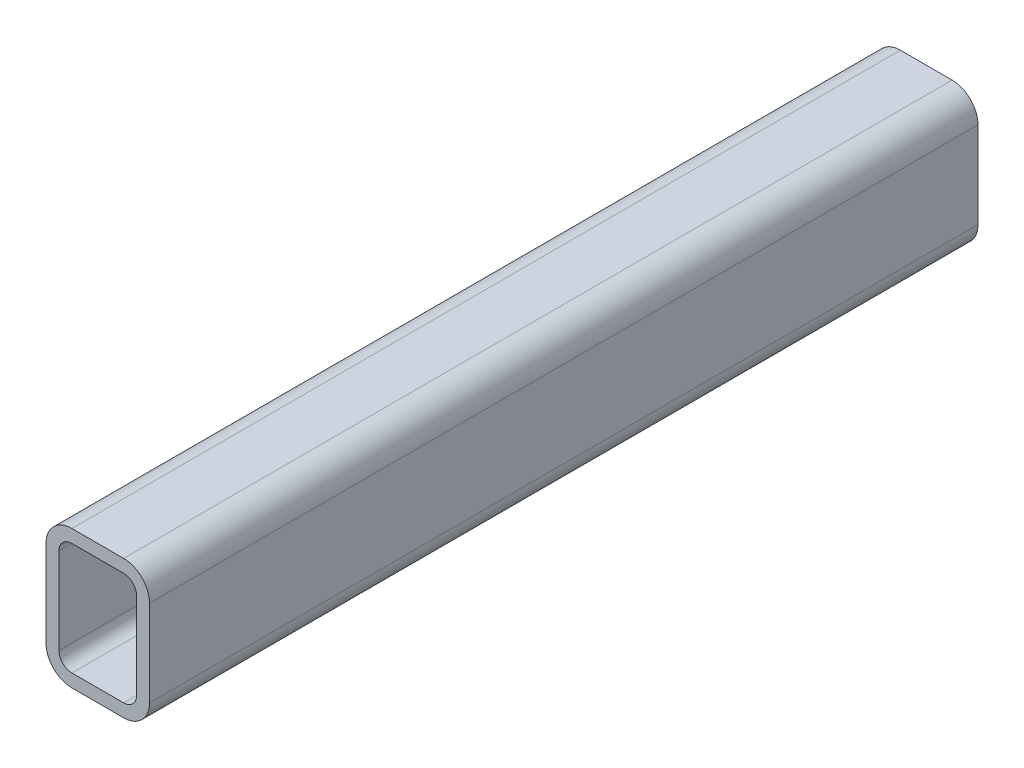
ISO-10303-21;
HEADER;
FILE_DESCRIPTION(('STEP AP214'),'2;1');
FILE_NAME('part.step','',(''),(''),'','','');
FILE_SCHEMA(('AUTOMOTIVE_DESIGN { 1 0 10303 214 1 1 1 1 }'));
ENDSEC;
DATA;
#1=APPLICATION_CONTEXT('core data for automotive mechanical design processes');
#2=APPLICATION_PROTOCOL_DEFINITION('international standard','automotive_design',2000,#1);
#3=PRODUCT_CONTEXT('',#1,'mechanical');
#4=PRODUCT('Part','Part','',(#3));
#5=PRODUCT_RELATED_PRODUCT_CATEGORY('part','',(#4));
#6=PRODUCT_DEFINITION_FORMATION('','',#4);
#7=PRODUCT_DEFINITION_CONTEXT('part definition',#1,'design');
#8=PRODUCT_DEFINITION('design','',#6,#7);
#9=PRODUCT_DEFINITION_SHAPE('','',#8);
#10=(LENGTH_UNIT() NAMED_UNIT(*) SI_UNIT(.MILLI.,.METRE.));
#11=(NAMED_UNIT(*) PLANE_ANGLE_UNIT() SI_UNIT($,.RADIAN.));
#12=(NAMED_UNIT(*) SI_UNIT($,.STERADIAN.) SOLID_ANGLE_UNIT());
#13=UNCERTAINTY_MEASURE_WITH_UNIT(LENGTH_MEASURE(1.E-05),#10,'distance_accuracy_value','');
#14=(GEOMETRIC_REPRESENTATION_CONTEXT(3) GLOBAL_UNCERTAINTY_ASSIGNED_CONTEXT((#13)) GLOBAL_UNIT_ASSIGNED_CONTEXT((#10,
#11,#12)) REPRESENTATION_CONTEXT('',''));
#15=CARTESIAN_POINT('',(0.,0.,0.));
#16=DIRECTION('',(0.,0.,1.));
#17=DIRECTION('',(1.,0.,0.));
#18=AXIS2_PLACEMENT_3D('',#15,#16,#17);
#19=CARTESIAN_POINT('',(9.525,41.275,304.8));
#20=DIRECTION('',(0.,0.,1.));
#21=DIRECTION('',(1.,0.,0.));
#22=AXIS2_PLACEMENT_3D('',#19,#20,#21);
#23=PLANE('',#22);
#24=CARTESIAN_POINT('',(9.525,41.275,304.8));
#25=DIRECTION('',(0.,0.,1.));
#26=DIRECTION('',(1.,0.,0.));
#27=AXIS2_PLACEMENT_3D('',#24,#25,#26);
#28=CIRCLE('',#27,9.525);
#29=CARTESIAN_POINT('',(9.525,50.8,304.8));
#30=VERTEX_POINT('',#29);
#31=CARTESIAN_POINT('',(0.,41.275,304.8));
#32=VERTEX_POINT('',#31);
#33=EDGE_CURVE('E211',#30,#32,#28,.T.);
#34=ORIENTED_EDGE('',*,*,#33,.T.);
#35=DIRECTION('',(0.,-1.,0.));
#36=VECTOR('',#35,1.);
#37=CARTESIAN_POINT('',(0.,9.525,304.8));
#38=LINE('',#37,#36);
#39=CARTESIAN_POINT('',(0.,9.525,304.8));
#40=VERTEX_POINT('',#39);
#41=EDGE_CURVE('E214',#32,#40,#38,.T.);
#42=ORIENTED_EDGE('',*,*,#41,.T.);
#43=CARTESIAN_POINT('',(9.525,9.525,304.8));
#44=DIRECTION('',(0.,0.,1.));
#45=DIRECTION('',(1.,0.,0.));
#46=AXIS2_PLACEMENT_3D('',#43,#44,#45);
#47=CIRCLE('',#46,9.525);
#48=CARTESIAN_POINT('',(9.525,0.,304.8));
#49=VERTEX_POINT('',#48);
#50=EDGE_CURVE('E217',#40,#49,#47,.T.);
#51=ORIENTED_EDGE('',*,*,#50,.T.);
#52=DIRECTION('',(1.,0.,0.));
#53=VECTOR('',#52,1.);
#54=CARTESIAN_POINT('',(28.575,0.,304.8));
#55=LINE('',#54,#53);
#56=CARTESIAN_POINT('',(28.575,0.,304.8));
#57=VERTEX_POINT('',#56);
#58=EDGE_CURVE('E219',#49,#57,#55,.T.);
#59=ORIENTED_EDGE('',*,*,#58,.T.);
#60=CARTESIAN_POINT('',(28.575,9.525,304.8));
#61=DIRECTION('',(0.,0.,1.));
#62=DIRECTION('',(1.,0.,0.));
#63=AXIS2_PLACEMENT_3D('',#60,#61,#62);
#64=CIRCLE('',#63,9.525);
#65=CARTESIAN_POINT('',(38.1,9.525,304.8));
#66=VERTEX_POINT('',#65);
#67=EDGE_CURVE('E221',#57,#66,#64,.T.);
#68=ORIENTED_EDGE('',*,*,#67,.T.);
#69=DIRECTION('',(0.,1.,0.));
#70=VECTOR('',#69,1.);
#71=CARTESIAN_POINT('',(38.1,41.275,304.8));
#72=LINE('',#71,#70);
#73=CARTESIAN_POINT('',(38.1,41.275,304.8));
#74=VERTEX_POINT('',#73);
#75=EDGE_CURVE('E223',#66,#74,#72,.T.);
#76=ORIENTED_EDGE('',*,*,#75,.T.);
#77=CARTESIAN_POINT('',(28.575,41.275,304.8));
#78=DIRECTION('',(0.,0.,1.));
#79=DIRECTION('',(1.,0.,0.));
#80=AXIS2_PLACEMENT_3D('',#77,#78,#79);
#81=CIRCLE('',#80,9.525);
#82=CARTESIAN_POINT('',(28.575,50.8,304.8));
#83=VERTEX_POINT('',#82);
#84=EDGE_CURVE('E225',#74,#83,#81,.T.);
#85=ORIENTED_EDGE('',*,*,#84,.T.);
#86=DIRECTION('',(-1.,0.,0.));
#87=VECTOR('',#86,1.);
#88=CARTESIAN_POINT('',(9.525,50.8,304.8));
#89=LINE('',#88,#87);
#90=EDGE_CURVE('E227',#83,#30,#89,.T.);
#91=ORIENTED_EDGE('',*,*,#90,.T.);
#92=EDGE_LOOP('',(#34,#42,#51,#59,#68,#76,#85,#91));
#93=FACE_BOUND('',#92,.T.);
#94=DIRECTION('',(0.,-1.,0.));
#95=VECTOR('',#94,1.);
#96=CARTESIAN_POINT('',(4.7625,9.525,304.8));
#97=LINE('',#96,#95);
#98=CARTESIAN_POINT('',(4.7625,41.275,304.8));
#99=VERTEX_POINT('',#98);
#100=CARTESIAN_POINT('',(4.7625,9.525,304.8));
#101=VERTEX_POINT('',#100);
#102=EDGE_CURVE('E154',#99,#101,#97,.T.);
#103=ORIENTED_EDGE('',*,*,#102,.F.);
#104=CARTESIAN_POINT('',(9.525,41.275,304.8));
#105=DIRECTION('',(0.,0.,1.));
#106=DIRECTION('',(1.,0.,0.));
#107=AXIS2_PLACEMENT_3D('',#104,#105,#106);
#108=CIRCLE('',#107,4.7625);
#109=CARTESIAN_POINT('',(9.525,46.0375,304.8));
#110=VERTEX_POINT('',#109);
#111=EDGE_CURVE('E146',#110,#99,#108,.T.);
#112=ORIENTED_EDGE('',*,*,#111,.F.);
#113=DIRECTION('',(-1.,0.,0.));
#114=VECTOR('',#113,1.);
#115=CARTESIAN_POINT('',(9.525,46.0375,304.8));
#116=LINE('',#115,#114);
#117=CARTESIAN_POINT('',(28.575,46.0375,304.8));
#118=VERTEX_POINT('',#117);
#119=EDGE_CURVE('E179',#118,#110,#116,.T.);
#120=ORIENTED_EDGE('',*,*,#119,.F.);
#121=CARTESIAN_POINT('',(28.575,41.275,304.8));
#122=DIRECTION('',(0.,0.,1.));
#123=DIRECTION('',(1.,0.,0.));
#124=AXIS2_PLACEMENT_3D('',#121,#122,#123);
#125=CIRCLE('',#124,4.7625);
#126=CARTESIAN_POINT('',(33.3375,41.275,304.8));
#127=VERTEX_POINT('',#126);
#128=EDGE_CURVE('E177',#127,#118,#125,.T.);
#129=ORIENTED_EDGE('',*,*,#128,.F.);
#130=DIRECTION('',(0.,1.,0.));
#131=VECTOR('',#130,1.);
#132=CARTESIAN_POINT('',(33.3375,41.275,304.8));
#133=LINE('',#132,#131);
#134=CARTESIAN_POINT('',(33.3375,9.525,304.8));
#135=VERTEX_POINT('',#134);
#136=EDGE_CURVE('E175',#135,#127,#133,.T.);
#137=ORIENTED_EDGE('',*,*,#136,.F.);
#138=CARTESIAN_POINT('',(28.575,9.525,304.8));
#139=DIRECTION('',(0.,0.,1.));
#140=DIRECTION('',(1.,0.,0.));
#141=AXIS2_PLACEMENT_3D('',#138,#139,#140);
#142=CIRCLE('',#141,4.7625);
#143=CARTESIAN_POINT('',(28.575,4.7625,304.8));
#144=VERTEX_POINT('',#143);
#145=EDGE_CURVE('E173',#144,#135,#142,.T.);
#146=ORIENTED_EDGE('',*,*,#145,.F.);
#147=DIRECTION('',(1.,0.,0.));
#148=VECTOR('',#147,1.);
#149=CARTESIAN_POINT('',(28.575,4.7625,304.8));
#150=LINE('',#149,#148);
#151=CARTESIAN_POINT('',(9.525,4.7625,304.8));
#152=VERTEX_POINT('',#151);
#153=EDGE_CURVE('E169',#152,#144,#150,.T.);
#154=ORIENTED_EDGE('',*,*,#153,.F.);
#155=CARTESIAN_POINT('',(9.525,9.525,304.8));
#156=DIRECTION('',(0.,0.,1.));
#157=DIRECTION('',(1.,0.,0.));
#158=AXIS2_PLACEMENT_3D('',#155,#156,#157);
#159=CIRCLE('',#158,4.7625);
#160=EDGE_CURVE('E167',#101,#152,#159,.T.);
#161=ORIENTED_EDGE('',*,*,#160,.F.);
#162=EDGE_LOOP('',(#103,#112,#120,#129,#137,#146,#154,#161));
#163=FACE_BOUND('',#162,.T.);
#164=ADVANCED_FACE('F33',(#93,#163),#23,.T.);
#165=CARTESIAN_POINT('',(9.525,41.275,0.));
#166=DIRECTION('',(0.,0.,1.));
#167=DIRECTION('',(1.,0.,0.));
#168=AXIS2_PLACEMENT_3D('',#165,#166,#167);
#169=PLANE('',#168);
#170=CARTESIAN_POINT('',(9.525,41.275,0.));
#171=DIRECTION('',(0.,0.,1.));
#172=DIRECTION('',(1.,0.,0.));
#173=AXIS2_PLACEMENT_3D('',#170,#171,#172);
#174=CIRCLE('',#173,9.525);
#175=CARTESIAN_POINT('',(9.525,50.8,0.));
#176=VERTEX_POINT('',#175);
#177=CARTESIAN_POINT('',(0.,41.275,0.));
#178=VERTEX_POINT('',#177);
#179=EDGE_CURVE('E162',#176,#178,#174,.T.);
#180=ORIENTED_EDGE('',*,*,#179,.F.);
#181=DIRECTION('',(-1.,0.,0.));
#182=VECTOR('',#181,1.);
#183=CARTESIAN_POINT('',(9.525,50.8,0.));
#184=LINE('',#183,#182);
#185=CARTESIAN_POINT('',(28.575,50.8,0.));
#186=VERTEX_POINT('',#185);
#187=EDGE_CURVE('E215',#186,#176,#184,.T.);
#188=ORIENTED_EDGE('',*,*,#187,.F.);
#189=CARTESIAN_POINT('',(28.575,41.275,0.));
#190=DIRECTION('',(0.,0.,1.));
#191=DIRECTION('',(1.,0.,0.));
#192=AXIS2_PLACEMENT_3D('',#189,#190,#191);
#193=CIRCLE('',#192,9.525);
#194=CARTESIAN_POINT('',(38.1,41.275,0.));
#195=VERTEX_POINT('',#194);
#196=EDGE_CURVE('E242',#195,#186,#193,.T.);
#197=ORIENTED_EDGE('',*,*,#196,.F.);
#198=DIRECTION('',(0.,1.,0.));
#199=VECTOR('',#198,1.);
#200=CARTESIAN_POINT('',(38.1,41.275,0.));
#201=LINE('',#200,#199);
#202=CARTESIAN_POINT('',(38.1,9.525,0.));
#203=VERTEX_POINT('',#202);
#204=EDGE_CURVE('E240',#203,#195,#201,.T.);
#205=ORIENTED_EDGE('',*,*,#204,.F.);
#206=CARTESIAN_POINT('',(28.575,9.525,0.));
#207=DIRECTION('',(0.,0.,1.));
#208=DIRECTION('',(1.,0.,0.));
#209=AXIS2_PLACEMENT_3D('',#206,#207,#208);
#210=CIRCLE('',#209,9.525);
#211=CARTESIAN_POINT('',(28.575,0.,0.));
#212=VERTEX_POINT('',#211);
#213=EDGE_CURVE('E238',#212,#203,#210,.T.);
#214=ORIENTED_EDGE('',*,*,#213,.F.);
#215=DIRECTION('',(1.,0.,0.));
#216=VECTOR('',#215,1.);
#217=CARTESIAN_POINT('',(28.575,0.,0.));
#218=LINE('',#217,#216);
#219=CARTESIAN_POINT('',(9.525,0.,0.));
#220=VERTEX_POINT('',#219);
#221=EDGE_CURVE('E236',#220,#212,#218,.T.);
#222=ORIENTED_EDGE('',*,*,#221,.F.);
#223=CARTESIAN_POINT('',(9.525,9.525,0.));
#224=DIRECTION('',(0.,0.,1.));
#225=DIRECTION('',(1.,0.,0.));
#226=AXIS2_PLACEMENT_3D('',#223,#224,#225);
#227=CIRCLE('',#226,9.525);
#228=CARTESIAN_POINT('',(0.,9.525,0.));
#229=VERTEX_POINT('',#228);
#230=EDGE_CURVE('E234',#229,#220,#227,.T.);
#231=ORIENTED_EDGE('',*,*,#230,.F.);
#232=DIRECTION('',(0.,-1.,0.));
#233=VECTOR('',#232,1.);
#234=CARTESIAN_POINT('',(0.,9.525,0.));
#235=LINE('',#234,#233);
#236=EDGE_CURVE('E232',#178,#229,#235,.T.);
#237=ORIENTED_EDGE('',*,*,#236,.F.);
#238=EDGE_LOOP('',(#180,#188,#197,#205,#214,#222,#231,#237));
#239=FACE_BOUND('',#238,.T.);
#240=CARTESIAN_POINT('',(9.525,41.275,0.));
#241=DIRECTION('',(0.,0.,1.));
#242=DIRECTION('',(1.,0.,0.));
#243=AXIS2_PLACEMENT_3D('',#240,#241,#242);
#244=CIRCLE('',#243,4.7625);
#245=CARTESIAN_POINT('',(9.525,46.0375,0.));
#246=VERTEX_POINT('',#245);
#247=CARTESIAN_POINT('',(4.7625,41.275,0.));
#248=VERTEX_POINT('',#247);
#249=EDGE_CURVE('E56',#246,#248,#244,.T.);
#250=ORIENTED_EDGE('',*,*,#249,.T.);
#251=DIRECTION('',(0.,-1.,0.));
#252=VECTOR('',#251,1.);
#253=CARTESIAN_POINT('',(4.7625,9.525,0.));
#254=LINE('',#253,#252);
#255=CARTESIAN_POINT('',(4.7625,9.525,0.));
#256=VERTEX_POINT('',#255);
#257=EDGE_CURVE('E161',#248,#256,#254,.T.);
#258=ORIENTED_EDGE('',*,*,#257,.T.);
#259=CARTESIAN_POINT('',(9.525,9.525,0.));
#260=DIRECTION('',(0.,0.,1.));
#261=DIRECTION('',(1.,0.,0.));
#262=AXIS2_PLACEMENT_3D('',#259,#260,#261);
#263=CIRCLE('',#262,4.7625);
#264=CARTESIAN_POINT('',(9.525,4.7625,0.));
#265=VERTEX_POINT('',#264);
#266=EDGE_CURVE('E183',#256,#265,#263,.T.);
#267=ORIENTED_EDGE('',*,*,#266,.T.);
#268=DIRECTION('',(1.,0.,0.));
#269=VECTOR('',#268,1.);
#270=CARTESIAN_POINT('',(28.575,4.7625,0.));
#271=LINE('',#270,#269);
#272=CARTESIAN_POINT('',(28.575,4.7625,0.));
#273=VERTEX_POINT('',#272);
#274=EDGE_CURVE('E186',#265,#273,#271,.T.);
#275=ORIENTED_EDGE('',*,*,#274,.T.);
#276=CARTESIAN_POINT('',(28.575,9.525,0.));
#277=DIRECTION('',(0.,0.,1.));
#278=DIRECTION('',(1.,0.,0.));
#279=AXIS2_PLACEMENT_3D('',#276,#277,#278);
#280=CIRCLE('',#279,4.7625);
#281=CARTESIAN_POINT('',(33.3375,9.525,0.));
#282=VERTEX_POINT('',#281);
#283=EDGE_CURVE('E189',#273,#282,#280,.T.);
#284=ORIENTED_EDGE('',*,*,#283,.T.);
#285=DIRECTION('',(0.,1.,0.));
#286=VECTOR('',#285,1.);
#287=CARTESIAN_POINT('',(33.3375,41.275,0.));
#288=LINE('',#287,#286);
#289=CARTESIAN_POINT('',(33.3375,41.275,0.));
#290=VERTEX_POINT('',#289);
#291=EDGE_CURVE('E192',#282,#290,#288,.T.);
#292=ORIENTED_EDGE('',*,*,#291,.T.);
#293=CARTESIAN_POINT('',(28.575,41.275,0.));
#294=DIRECTION('',(0.,0.,1.));
#295=DIRECTION('',(1.,0.,0.));
#296=AXIS2_PLACEMENT_3D('',#293,#294,#295);
#297=CIRCLE('',#296,4.7625);
#298=CARTESIAN_POINT('',(28.575,46.0375,0.));
#299=VERTEX_POINT('',#298);
#300=EDGE_CURVE('E195',#290,#299,#297,.T.);
#301=ORIENTED_EDGE('',*,*,#300,.T.);
#302=DIRECTION('',(-1.,0.,0.));
#303=VECTOR('',#302,1.);
#304=CARTESIAN_POINT('',(9.525,46.0375,0.));
#305=LINE('',#304,#303);
#306=EDGE_CURVE('E155',#299,#246,#305,.T.);
#307=ORIENTED_EDGE('',*,*,#306,.T.);
#308=EDGE_LOOP('',(#250,#258,#267,#275,#284,#292,#301,#307));
#309=FACE_BOUND('',#308,.T.);
#310=ADVANCED_FACE('F272',(#239,#309),#169,.F.);
#311=CARTESIAN_POINT('',(9.525,41.275,304.8));
#312=DIRECTION('',(0.,0.,-1.));
#313=DIRECTION('',(-1.,0.,0.));
#314=AXIS2_PLACEMENT_3D('',#311,#312,#313);
#315=CYLINDRICAL_SURFACE('',#314,9.525);
#316=ORIENTED_EDGE('',*,*,#179,.T.);
#317=DIRECTION('',(0.,0.,-1.));
#318=VECTOR('',#317,1.);
#319=CARTESIAN_POINT('',(0.,41.275,304.8));
#320=LINE('',#319,#318);
#321=EDGE_CURVE('E11',#32,#178,#320,.T.);
#322=ORIENTED_EDGE('',*,*,#321,.F.);
#323=ORIENTED_EDGE('',*,*,#33,.F.);
#324=DIRECTION('',(0.,0.,-1.));
#325=VECTOR('',#324,1.);
#326=CARTESIAN_POINT('',(9.525,50.8,304.8));
#327=LINE('',#326,#325);
#328=EDGE_CURVE('E229',#30,#176,#327,.T.);
#329=ORIENTED_EDGE('',*,*,#328,.T.);
#330=EDGE_LOOP('',(#316,#322,#323,#329));
#331=FACE_BOUND('',#330,.T.);
#332=ADVANCED_FACE('F35',(#331),#315,.T.);
#333=CARTESIAN_POINT('',(0.,9.525,304.8));
#334=DIRECTION('',(1.,0.,0.));
#335=DIRECTION('',(0.,0.,-1.));
#336=AXIS2_PLACEMENT_3D('',#333,#334,#335);
#337=PLANE('',#336);
#338=ORIENTED_EDGE('',*,*,#236,.T.);
#339=DIRECTION('',(0.,0.,-1.));
#340=VECTOR('',#339,1.);
#341=CARTESIAN_POINT('',(0.,9.525,304.8));
#342=LINE('',#341,#340);
#343=EDGE_CURVE('E41',#40,#229,#342,.T.);
#344=ORIENTED_EDGE('',*,*,#343,.F.);
#345=ORIENTED_EDGE('',*,*,#41,.F.);
#346=ORIENTED_EDGE('',*,*,#321,.T.);
#347=EDGE_LOOP('',(#338,#344,#345,#346));
#348=FACE_BOUND('',#347,.T.);
#349=ADVANCED_FACE('F289',(#348),#337,.F.);
#350=CARTESIAN_POINT('',(9.525,9.525,304.8));
#351=DIRECTION('',(0.,0.,-1.));
#352=DIRECTION('',(-1.,0.,0.));
#353=AXIS2_PLACEMENT_3D('',#350,#351,#352);
#354=CYLINDRICAL_SURFACE('',#353,9.525);
#355=ORIENTED_EDGE('',*,*,#230,.T.);
#356=DIRECTION('',(0.,0.,-1.));
#357=VECTOR('',#356,1.);
#358=CARTESIAN_POINT('',(9.525,0.,304.8));
#359=LINE('',#358,#357);
#360=EDGE_CURVE('E259',#49,#220,#359,.T.);
#361=ORIENTED_EDGE('',*,*,#360,.F.);
#362=ORIENTED_EDGE('',*,*,#50,.F.);
#363=ORIENTED_EDGE('',*,*,#343,.T.);
#364=EDGE_LOOP('',(#355,#361,#362,#363));
#365=FACE_BOUND('',#364,.T.);
#366=ADVANCED_FACE('F266',(#365),#354,.T.);
#367=CARTESIAN_POINT('',(28.575,0.,304.8));
#368=DIRECTION('',(0.,1.,0.));
#369=DIRECTION('',(0.,0.,1.));
#370=AXIS2_PLACEMENT_3D('',#367,#368,#369);
#371=PLANE('',#370);
#372=ORIENTED_EDGE('',*,*,#221,.T.);
#373=DIRECTION('',(0.,0.,-1.));
#374=VECTOR('',#373,1.);
#375=CARTESIAN_POINT('',(28.575,0.,304.8));
#376=LINE('',#375,#374);
#377=EDGE_CURVE('E256',#57,#212,#376,.T.);
#378=ORIENTED_EDGE('',*,*,#377,.F.);
#379=ORIENTED_EDGE('',*,*,#58,.F.);
#380=ORIENTED_EDGE('',*,*,#360,.T.);
#381=EDGE_LOOP('',(#372,#378,#379,#380));
#382=FACE_BOUND('',#381,.T.);
#383=ADVANCED_FACE('F278',(#382),#371,.F.);
#384=CARTESIAN_POINT('',(28.575,9.525,304.8));
#385=DIRECTION('',(0.,0.,-1.));
#386=DIRECTION('',(-1.,0.,0.));
#387=AXIS2_PLACEMENT_3D('',#384,#385,#386);
#388=CYLINDRICAL_SURFACE('',#387,9.525);
#389=ORIENTED_EDGE('',*,*,#213,.T.);
#390=DIRECTION('',(0.,0.,-1.));
#391=VECTOR('',#390,1.);
#392=CARTESIAN_POINT('',(38.1,9.525,304.8));
#393=LINE('',#392,#391);
#394=EDGE_CURVE('E253',#66,#203,#393,.T.);
#395=ORIENTED_EDGE('',*,*,#394,.F.);
#396=ORIENTED_EDGE('',*,*,#67,.F.);
#397=ORIENTED_EDGE('',*,*,#377,.T.);
#398=EDGE_LOOP('',(#389,#395,#396,#397));
#399=FACE_BOUND('',#398,.T.);
#400=ADVANCED_FACE('F282',(#399),#388,.T.);
#401=CARTESIAN_POINT('',(38.1,41.275,304.8));
#402=DIRECTION('',(-1.,0.,0.));
#403=DIRECTION('',(0.,0.,1.));
#404=AXIS2_PLACEMENT_3D('',#401,#402,#403);
#405=PLANE('',#404);
#406=ORIENTED_EDGE('',*,*,#204,.T.);
#407=DIRECTION('',(0.,0.,-1.));
#408=VECTOR('',#407,1.);
#409=CARTESIAN_POINT('',(38.1,41.275,304.8));
#410=LINE('',#409,#408);
#411=EDGE_CURVE('E250',#74,#195,#410,.T.);
#412=ORIENTED_EDGE('',*,*,#411,.F.);
#413=ORIENTED_EDGE('',*,*,#75,.F.);
#414=ORIENTED_EDGE('',*,*,#394,.T.);
#415=EDGE_LOOP('',(#406,#412,#413,#414));
#416=FACE_BOUND('',#415,.T.);
#417=ADVANCED_FACE('F302',(#416),#405,.F.);
#418=CARTESIAN_POINT('',(28.575,41.275,304.8));
#419=DIRECTION('',(0.,0.,-1.));
#420=DIRECTION('',(-1.,0.,0.));
#421=AXIS2_PLACEMENT_3D('',#418,#419,#420);
#422=CYLINDRICAL_SURFACE('',#421,9.525);
#423=ORIENTED_EDGE('',*,*,#196,.T.);
#424=DIRECTION('',(0.,0.,-1.));
#425=VECTOR('',#424,1.);
#426=CARTESIAN_POINT('',(28.575,50.8,304.8));
#427=LINE('',#426,#425);
#428=EDGE_CURVE('E247',#83,#186,#427,.T.);
#429=ORIENTED_EDGE('',*,*,#428,.F.);
#430=ORIENTED_EDGE('',*,*,#84,.F.);
#431=ORIENTED_EDGE('',*,*,#411,.T.);
#432=EDGE_LOOP('',(#423,#429,#430,#431));
#433=FACE_BOUND('',#432,.T.);
#434=ADVANCED_FACE('F300',(#433),#422,.T.);
#435=CARTESIAN_POINT('',(9.525,50.8,304.8));
#436=DIRECTION('',(0.,-1.,0.));
#437=DIRECTION('',(0.,0.,-1.));
#438=AXIS2_PLACEMENT_3D('',#435,#436,#437);
#439=PLANE('',#438);
#440=ORIENTED_EDGE('',*,*,#187,.T.);
#441=ORIENTED_EDGE('',*,*,#328,.F.);
#442=ORIENTED_EDGE('',*,*,#90,.F.);
#443=ORIENTED_EDGE('',*,*,#428,.T.);
#444=EDGE_LOOP('',(#440,#441,#442,#443));
#445=FACE_BOUND('',#444,.T.);
#446=ADVANCED_FACE('F295',(#445),#439,.F.);
#447=CARTESIAN_POINT('',(9.525,41.275,304.8));
#448=DIRECTION('',(0.,0.,-1.));
#449=DIRECTION('',(-1.,0.,0.));
#450=AXIS2_PLACEMENT_3D('',#447,#448,#449);
#451=CYLINDRICAL_SURFACE('',#450,4.7625);
#452=ORIENTED_EDGE('',*,*,#249,.F.);
#453=DIRECTION('',(0.,0.,-1.));
#454=VECTOR('',#453,1.);
#455=CARTESIAN_POINT('',(9.525,46.0375,304.8));
#456=LINE('',#455,#454);
#457=EDGE_CURVE('E150',#110,#246,#456,.T.);
#458=ORIENTED_EDGE('',*,*,#457,.F.);
#459=ORIENTED_EDGE('',*,*,#111,.T.);
#460=DIRECTION('',(0.,0.,-1.));
#461=VECTOR('',#460,1.);
#462=CARTESIAN_POINT('',(4.7625,41.275,304.8));
#463=LINE('',#462,#461);
#464=EDGE_CURVE('E149',#99,#248,#463,.T.);
#465=ORIENTED_EDGE('',*,*,#464,.T.);
#466=EDGE_LOOP('',(#452,#458,#459,#465));
#467=FACE_BOUND('',#466,.T.);
#468=ADVANCED_FACE('F148',(#467),#451,.F.);
#469=CARTESIAN_POINT('',(4.7625,9.525,304.8));
#470=DIRECTION('',(1.,0.,0.));
#471=DIRECTION('',(0.,0.,-1.));
#472=AXIS2_PLACEMENT_3D('',#469,#470,#471);
#473=PLANE('',#472);
#474=ORIENTED_EDGE('',*,*,#257,.F.);
#475=ORIENTED_EDGE('',*,*,#464,.F.);
#476=ORIENTED_EDGE('',*,*,#102,.T.);
#477=DIRECTION('',(0.,0.,-1.));
#478=VECTOR('',#477,1.);
#479=CARTESIAN_POINT('',(4.7625,9.525,304.8));
#480=LINE('',#479,#478);
#481=EDGE_CURVE('E163',#101,#256,#480,.T.);
#482=ORIENTED_EDGE('',*,*,#481,.T.);
#483=EDGE_LOOP('',(#474,#475,#476,#482));
#484=FACE_BOUND('',#483,.T.);
#485=ADVANCED_FACE('F158',(#484),#473,.T.);
#486=CARTESIAN_POINT('',(9.525,9.525,304.8));
#487=DIRECTION('',(0.,0.,-1.));
#488=DIRECTION('',(-1.,0.,0.));
#489=AXIS2_PLACEMENT_3D('',#486,#487,#488);
#490=CYLINDRICAL_SURFACE('',#489,4.7625);
#491=ORIENTED_EDGE('',*,*,#266,.F.);
#492=ORIENTED_EDGE('',*,*,#481,.F.);
#493=ORIENTED_EDGE('',*,*,#160,.T.);
#494=DIRECTION('',(0.,0.,-1.));
#495=VECTOR('',#494,1.);
#496=CARTESIAN_POINT('',(9.525,4.7625,304.8));
#497=LINE('',#496,#495);
#498=EDGE_CURVE('E208',#152,#265,#497,.T.);
#499=ORIENTED_EDGE('',*,*,#498,.T.);
#500=EDGE_LOOP('',(#491,#492,#493,#499));
#501=FACE_BOUND('',#500,.T.);
#502=ADVANCED_FACE('F327',(#501),#490,.F.);
#503=CARTESIAN_POINT('',(28.575,4.7625,304.8));
#504=DIRECTION('',(0.,1.,0.));
#505=DIRECTION('',(0.,0.,1.));
#506=AXIS2_PLACEMENT_3D('',#503,#504,#505);
#507=PLANE('',#506);
#508=ORIENTED_EDGE('',*,*,#274,.F.);
#509=ORIENTED_EDGE('',*,*,#498,.F.);
#510=ORIENTED_EDGE('',*,*,#153,.T.);
#511=DIRECTION('',(0.,0.,-1.));
#512=VECTOR('',#511,1.);
#513=CARTESIAN_POINT('',(28.575,4.7625,304.8));
#514=LINE('',#513,#512);
#515=EDGE_CURVE('E206',#144,#273,#514,.T.);
#516=ORIENTED_EDGE('',*,*,#515,.T.);
#517=EDGE_LOOP('',(#508,#509,#510,#516));
#518=FACE_BOUND('',#517,.T.);
#519=ADVANCED_FACE('F331',(#518),#507,.T.);
#520=CARTESIAN_POINT('',(28.575,9.525,304.8));
#521=DIRECTION('',(0.,0.,-1.));
#522=DIRECTION('',(-1.,0.,0.));
#523=AXIS2_PLACEMENT_3D('',#520,#521,#522);
#524=CYLINDRICAL_SURFACE('',#523,4.7625);
#525=ORIENTED_EDGE('',*,*,#283,.F.);
#526=ORIENTED_EDGE('',*,*,#515,.F.);
#527=ORIENTED_EDGE('',*,*,#145,.T.);
#528=DIRECTION('',(0.,0.,-1.));
#529=VECTOR('',#528,1.);
#530=CARTESIAN_POINT('',(33.3375,9.525,304.8));
#531=LINE('',#530,#529);
#532=EDGE_CURVE('E204',#135,#282,#531,.T.);
#533=ORIENTED_EDGE('',*,*,#532,.T.);
#534=EDGE_LOOP('',(#525,#526,#527,#533));
#535=FACE_BOUND('',#534,.T.);
#536=ADVANCED_FACE('F337',(#535),#524,.F.);
#537=CARTESIAN_POINT('',(33.3375,41.275,304.8));
#538=DIRECTION('',(-1.,0.,0.));
#539=DIRECTION('',(0.,0.,1.));
#540=AXIS2_PLACEMENT_3D('',#537,#538,#539);
#541=PLANE('',#540);
#542=ORIENTED_EDGE('',*,*,#291,.F.);
#543=ORIENTED_EDGE('',*,*,#532,.F.);
#544=ORIENTED_EDGE('',*,*,#136,.T.);
#545=DIRECTION('',(0.,0.,-1.));
#546=VECTOR('',#545,1.);
#547=CARTESIAN_POINT('',(33.3375,41.275,304.8));
#548=LINE('',#547,#546);
#549=EDGE_CURVE('E202',#127,#290,#548,.T.);
#550=ORIENTED_EDGE('',*,*,#549,.T.);
#551=EDGE_LOOP('',(#542,#543,#544,#550));
#552=FACE_BOUND('',#551,.T.);
#553=ADVANCED_FACE('F341',(#552),#541,.T.);
#554=CARTESIAN_POINT('',(28.575,41.275,304.8));
#555=DIRECTION('',(0.,0.,-1.));
#556=DIRECTION('',(-1.,0.,0.));
#557=AXIS2_PLACEMENT_3D('',#554,#555,#556);
#558=CYLINDRICAL_SURFACE('',#557,4.7625);
#559=ORIENTED_EDGE('',*,*,#300,.F.);
#560=ORIENTED_EDGE('',*,*,#549,.F.);
#561=ORIENTED_EDGE('',*,*,#128,.T.);
#562=DIRECTION('',(0.,0.,-1.));
#563=VECTOR('',#562,1.);
#564=CARTESIAN_POINT('',(28.575,46.0375,304.8));
#565=LINE('',#564,#563);
#566=EDGE_CURVE('E48',#118,#299,#565,.T.);
#567=ORIENTED_EDGE('',*,*,#566,.T.);
#568=EDGE_LOOP('',(#559,#560,#561,#567));
#569=FACE_BOUND('',#568,.T.);
#570=ADVANCED_FACE('F345',(#569),#558,.F.);
#571=CARTESIAN_POINT('',(9.525,46.0375,304.8));
#572=DIRECTION('',(0.,-1.,0.));
#573=DIRECTION('',(0.,0.,-1.));
#574=AXIS2_PLACEMENT_3D('',#571,#572,#573);
#575=PLANE('',#574);
#576=ORIENTED_EDGE('',*,*,#306,.F.);
#577=ORIENTED_EDGE('',*,*,#566,.F.);
#578=ORIENTED_EDGE('',*,*,#119,.T.);
#579=ORIENTED_EDGE('',*,*,#457,.T.);
#580=EDGE_LOOP('',(#576,#577,#578,#579));
#581=FACE_BOUND('',#580,.T.);
#582=ADVANCED_FACE('F349',(#581),#575,.T.);
#583=CLOSED_SHELL('',(#164,#310,#332,#349,#366,#383,#400,#417,#434,#446,#468,#485,#502,#519,
#536,#553,#570,#582));
#584=MANIFOLD_SOLID_BREP('B2',#583);
#585=ADVANCED_BREP_SHAPE_REPRESENTATION('',(#18,#584),#14);
#586=SHAPE_DEFINITION_REPRESENTATION(#9,#585);
ENDSEC;
END-ISO-10303-21;
